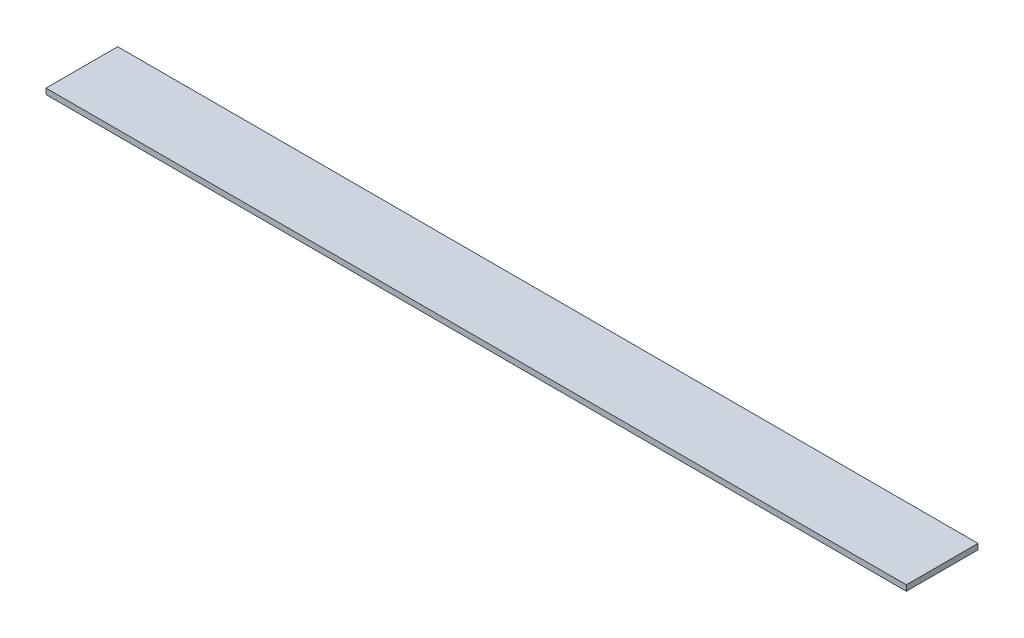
from build123d import *

# Parameters (mm, degrees)
SKETCH1_W           = 609.6
SKETCH1_H           = 50.8
BOSS_EXTRUDE1_DEPTH = 4


with BuildPart() as part:
    # Sketch1 → Boss-Extrude1 (new body)
    with BuildSketch(Plane(origin=(0, 0, 0), x_dir=(1, 0, 0), z_dir=(0, 1, 0))):
        Rectangle(SKETCH1_W, SKETCH1_H)
    extrude(amount=BOSS_EXTRUDE1_DEPTH)


solid = part.part
